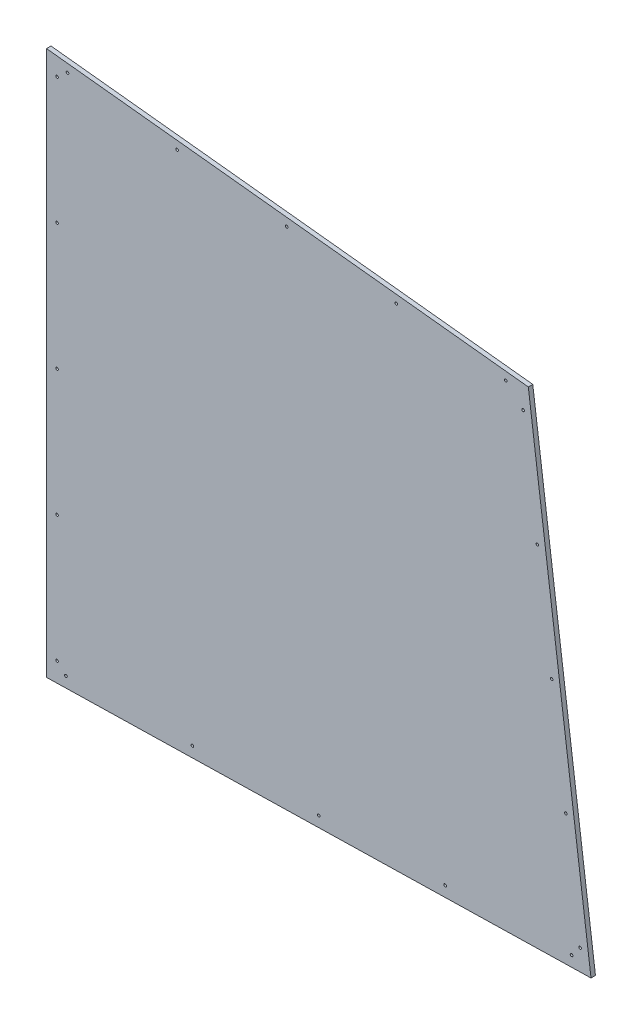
from build123d import *

# Parameters (mm, degrees)
BOSS_EXTRUDE1_DEPTH = 8.73125
SKETCH3_R           = 2.57937
CUT_EXTRUDE2_DEPTH  = 1258.593206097


with BuildPart() as part:
    # Sketch1 → Boss-Extrude1 (new body)
    with BuildSketch(Plane.XY):
        Polygon((-175.501921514, -179.383996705), (-175.501921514, 887.416003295), (768.265646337, 785.25956287), (891.042801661, -156.047470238), align=None)
    extrude(amount=BOSS_EXTRUDE1_DEPTH)

    # Sketch3 → Cut-Extrude2 (cut, through all)
    with BuildSketch(Plane.XY.offset(8.73125)):
        with Locations((-134.466618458, 867.006480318)):
            Circle(SKETCH3_R)
        with Locations((-154.864421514, 849.76756201)):
            Circle(SKETCH3_R)
        with Locations((80.179582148, 843.772484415)):
            Circle(SKETCH3_R)
        with Locations((294.825782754, 820.538488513)):
            Circle(SKETCH3_R)
        with Locations((509.471983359, 797.30449261)):
            Circle(SKETCH3_R)
        with Locations((724.118183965, 774.070496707)):
            Circle(SKETCH3_R)
        with Locations((758.04499481, 740.877900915)):
            Circle(SKETCH3_R)
        with Locations((785.968872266, 526.791313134)):
            Circle(SKETCH3_R)
        with Locations((813.892749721, 312.704725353)):
            Circle(SKETCH3_R)
        with Locations((841.816627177, 98.618137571)):
            Circle(SKETCH3_R)
        with Locations((869.740504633, -115.46845021)):
            Circle(SKETCH3_R)
        with Locations((852.95191869, -136.238478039)):
            Circle(SKETCH3_R)
        with Locations((605.361179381, -141.655885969)):
            Circle(SKETCH3_R)
        with Locations((357.770440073, -147.073293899)):
            Circle(SKETCH3_R)
        with Locations((110.179700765, -152.490701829)):
            Circle(SKETCH3_R)
        with Locations((-137.411038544, -157.908109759)):
            Circle(SKETCH3_R)
        with Locations((-154.864421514, -140.83243799)):
            Circle(SKETCH3_R)
        with Locations((-154.864421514, 106.81756201)):
            Circle(SKETCH3_R)
        with Locations((-154.864421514, 354.46756201)):
            Circle(SKETCH3_R)
        with Locations((-154.864421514, 602.11756201)):
            Circle(SKETCH3_R)
    extrude(amount=-CUT_EXTRUDE2_DEPTH, mode=Mode.SUBTRACT)


solid = part.part
